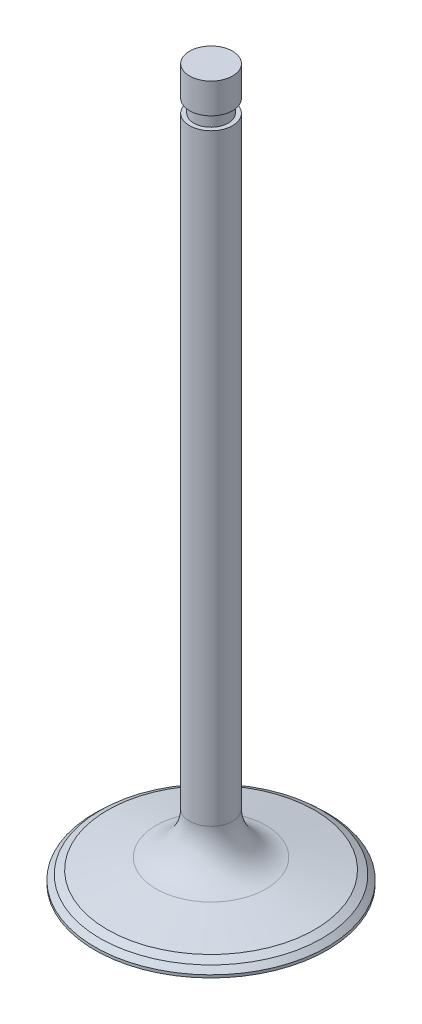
ISO-10303-21;
HEADER;
FILE_DESCRIPTION(('STEP AP214'),'2;1');
FILE_NAME('part.step','',(''),(''),'','','');
FILE_SCHEMA(('AUTOMOTIVE_DESIGN { 1 0 10303 214 1 1 1 1 }'));
ENDSEC;
DATA;
#1=APPLICATION_CONTEXT('core data for automotive mechanical design processes');
#2=APPLICATION_PROTOCOL_DEFINITION('international standard','automotive_design',2000,#1);
#3=PRODUCT_CONTEXT('',#1,'mechanical');
#4=PRODUCT('Part','Part','',(#3));
#5=PRODUCT_RELATED_PRODUCT_CATEGORY('part','',(#4));
#6=PRODUCT_DEFINITION_FORMATION('','',#4);
#7=PRODUCT_DEFINITION_CONTEXT('part definition',#1,'design');
#8=PRODUCT_DEFINITION('design','',#6,#7);
#9=PRODUCT_DEFINITION_SHAPE('','',#8);
#10=(LENGTH_UNIT() NAMED_UNIT(*) SI_UNIT(.MILLI.,.METRE.));
#11=(NAMED_UNIT(*) PLANE_ANGLE_UNIT() SI_UNIT($,.RADIAN.));
#12=(NAMED_UNIT(*) SI_UNIT($,.STERADIAN.) SOLID_ANGLE_UNIT());
#13=UNCERTAINTY_MEASURE_WITH_UNIT(LENGTH_MEASURE(1.E-05),#10,'distance_accuracy_value','');
#14=(GEOMETRIC_REPRESENTATION_CONTEXT(3) GLOBAL_UNCERTAINTY_ASSIGNED_CONTEXT((#13)) GLOBAL_UNIT_ASSIGNED_CONTEXT((#10,
#11,#12)) REPRESENTATION_CONTEXT('',''));
#15=CARTESIAN_POINT('',(0.,0.,0.));
#16=DIRECTION('',(0.,0.,1.));
#17=DIRECTION('',(1.,0.,0.));
#18=AXIS2_PLACEMENT_3D('',#15,#16,#17);
#19=CARTESIAN_POINT('',(0.,0.,0.));
#20=DIRECTION('',(0.,1.,0.));
#21=DIRECTION('',(0.,0.,1.));
#22=AXIS2_PLACEMENT_3D('',#19,#20,#21);
#23=PLANE('',#22);
#24=CARTESIAN_POINT('',(0.,0.,0.));
#25=DIRECTION('',(0.,-1.,0.));
#26=DIRECTION('',(0.,0.,-1.));
#27=AXIS2_PLACEMENT_3D('',#24,#25,#26);
#28=CIRCLE('',#27,27.);
#29=CARTESIAN_POINT('',(0.,0.,-27.));
#30=VERTEX_POINT('',#29);
#31=EDGE_CURVE('E62',#30,#30,#28,.T.);
#32=ORIENTED_EDGE('',*,*,#31,.T.);
#33=EDGE_LOOP('',(#32));
#34=FACE_BOUND('',#33,.T.);
#35=ADVANCED_FACE('F34',(#34),#23,.F.);
#36=CARTESIAN_POINT('',(0.,0.,0.));
#37=DIRECTION('',(0.,-1.,0.));
#38=DIRECTION('',(0.,0.,-1.));
#39=AXIS2_PLACEMENT_3D('',#36,#37,#38);
#40=CYLINDRICAL_SURFACE('',#39,27.);
#41=CARTESIAN_POINT('',(0.,0.637006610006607,0.));
#42=DIRECTION('',(0.,-1.,0.));
#43=DIRECTION('',(0.,0.,-1.));
#44=AXIS2_PLACEMENT_3D('',#41,#42,#43);
#45=CIRCLE('',#44,27.);
#46=CARTESIAN_POINT('',(0.,0.637006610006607,-27.));
#47=VERTEX_POINT('',#46);
#48=EDGE_CURVE('E47',#47,#47,#45,.T.);
#49=ORIENTED_EDGE('',*,*,#48,.T.);
#50=EDGE_LOOP('',(#49));
#51=FACE_BOUND('',#50,.T.);
#52=ORIENTED_EDGE('',*,*,#31,.F.);
#53=EDGE_LOOP('',(#52));
#54=FACE_BOUND('',#53,.T.);
#55=ADVANCED_FACE('F104',(#51,#54),#40,.T.);
#56=CARTESIAN_POINT('',(0.,7.,0.));
#57=DIRECTION('',(0.,-1.,0.));
#58=DIRECTION('',(0.,0.,-1.));
#59=AXIS2_PLACEMENT_3D('',#56,#57,#58);
#60=CONICAL_SURFACE('',#59,5.,1.34731972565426);
#61=CARTESIAN_POINT('',(0.,2.6648633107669,0.));
#62=DIRECTION('',(0.,-1.,0.));
#63=DIRECTION('',(0.,0.,-1.));
#64=AXIS2_PLACEMENT_3D('',#61,#62,#63);
#65=CIRCLE('',#64,24.0746014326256);
#66=CARTESIAN_POINT('',(0.,2.6648633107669,-24.0746014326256));
#67=VERTEX_POINT('',#66);
#68=EDGE_CURVE('E42',#67,#67,#65,.F.);
#69=ORIENTED_EDGE('',*,*,#68,.T.);
#70=EDGE_LOOP('',(#69));
#71=FACE_BOUND('',#70,.T.);
#72=CARTESIAN_POINT('',(0.,5.23095705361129,0.));
#73=DIRECTION('',(0.,-1.,0.));
#74=DIRECTION('',(0.,0.,-1.));
#75=AXIS2_PLACEMENT_3D('',#72,#73,#74);
#76=CIRCLE('',#75,12.7837889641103);
#77=CARTESIAN_POINT('',(0.,5.23095705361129,-12.7837889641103));
#78=VERTEX_POINT('',#77);
#79=EDGE_CURVE('E58',#78,#78,#76,.T.);
#80=ORIENTED_EDGE('',*,*,#79,.T.);
#81=EDGE_LOOP('',(#80));
#82=FACE_BOUND('',#81,.T.);
#83=ADVANCED_FACE('F110',(#71,#82),#60,.T.);
#84=CARTESIAN_POINT('',(0.,0.,0.));
#85=DIRECTION('',(0.,-1.,0.));
#86=DIRECTION('',(0.,0.,-1.));
#87=AXIS2_PLACEMENT_3D('',#84,#85,#86);
#88=CYLINDRICAL_SURFACE('',#87,5.);
#89=CARTESIAN_POINT('',(0.,14.9822856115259,0.));
#90=DIRECTION('',(0.,-1.,0.));
#91=DIRECTION('',(0.,0.,-1.));
#92=AXIS2_PLACEMENT_3D('',#89,#90,#91);
#93=CIRCLE('',#92,5.);
#94=CARTESIAN_POINT('',(0.,14.9822856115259,-5.));
#95=VERTEX_POINT('',#94);
#96=EDGE_CURVE('E52',#95,#95,#93,.F.);
#97=ORIENTED_EDGE('',*,*,#96,.T.);
#98=EDGE_LOOP('',(#97));
#99=FACE_BOUND('',#98,.T.);
#100=CARTESIAN_POINT('',(0.,155.,0.));
#101=DIRECTION('',(0.,-1.,0.));
#102=DIRECTION('',(0.,0.,-1.));
#103=AXIS2_PLACEMENT_3D('',#100,#101,#102);
#104=CIRCLE('',#103,5.);
#105=CARTESIAN_POINT('',(0.,155.,-5.));
#106=VERTEX_POINT('',#105);
#107=EDGE_CURVE('E66',#106,#106,#104,.T.);
#108=ORIENTED_EDGE('',*,*,#107,.T.);
#109=EDGE_LOOP('',(#108));
#110=FACE_BOUND('',#109,.T.);
#111=ADVANCED_FACE('F132',(#99,#110),#88,.T.);
#112=CARTESIAN_POINT('',(-4.,155.,0.));
#113=DIRECTION('',(0.,-1.,0.));
#114=DIRECTION('',(0.,0.,-1.));
#115=AXIS2_PLACEMENT_3D('',#112,#113,#114);
#116=PLANE('',#115);
#117=ORIENTED_EDGE('',*,*,#107,.F.);
#118=EDGE_LOOP('',(#117));
#119=FACE_BOUND('',#118,.T.);
#120=CARTESIAN_POINT('',(0.,155.,0.));
#121=DIRECTION('',(0.,-1.,0.));
#122=DIRECTION('',(0.,0.,-1.));
#123=AXIS2_PLACEMENT_3D('',#120,#121,#122);
#124=CIRCLE('',#123,4.);
#125=CARTESIAN_POINT('',(0.,155.,-4.));
#126=VERTEX_POINT('',#125);
#127=EDGE_CURVE('E70',#126,#126,#124,.T.);
#128=ORIENTED_EDGE('',*,*,#127,.T.);
#129=EDGE_LOOP('',(#128));
#130=FACE_BOUND('',#129,.T.);
#131=ADVANCED_FACE('F165',(#119,#130),#116,.F.);
#132=CARTESIAN_POINT('',(0.,0.,0.));
#133=DIRECTION('',(0.,-1.,0.));
#134=DIRECTION('',(0.,0.,-1.));
#135=AXIS2_PLACEMENT_3D('',#132,#133,#134);
#136=CYLINDRICAL_SURFACE('',#135,4.);
#137=ORIENTED_EDGE('',*,*,#127,.F.);
#138=EDGE_LOOP('',(#137));
#139=FACE_BOUND('',#138,.T.);
#140=CARTESIAN_POINT('',(0.,158.,0.));
#141=DIRECTION('',(0.,-1.,0.));
#142=DIRECTION('',(0.,0.,-1.));
#143=AXIS2_PLACEMENT_3D('',#140,#141,#142);
#144=CIRCLE('',#143,4.);
#145=CARTESIAN_POINT('',(0.,158.,-4.));
#146=VERTEX_POINT('',#145);
#147=EDGE_CURVE('E74',#146,#146,#144,.T.);
#148=ORIENTED_EDGE('',*,*,#147,.T.);
#149=EDGE_LOOP('',(#148));
#150=FACE_BOUND('',#149,.T.);
#151=ADVANCED_FACE('F157',(#139,#150),#136,.T.);
#152=CARTESIAN_POINT('',(-5.,158.,0.));
#153=DIRECTION('',(0.,1.,0.));
#154=DIRECTION('',(0.,0.,1.));
#155=AXIS2_PLACEMENT_3D('',#152,#153,#154);
#156=PLANE('',#155);
#157=ORIENTED_EDGE('',*,*,#147,.F.);
#158=EDGE_LOOP('',(#157));
#159=FACE_BOUND('',#158,.T.);
#160=CARTESIAN_POINT('',(0.,158.,0.));
#161=DIRECTION('',(0.,-1.,0.));
#162=DIRECTION('',(0.,0.,-1.));
#163=AXIS2_PLACEMENT_3D('',#160,#161,#162);
#164=CIRCLE('',#163,5.);
#165=CARTESIAN_POINT('',(0.,158.,-5.));
#166=VERTEX_POINT('',#165);
#167=EDGE_CURVE('E78',#166,#166,#164,.T.);
#168=ORIENTED_EDGE('',*,*,#167,.T.);
#169=EDGE_LOOP('',(#168));
#170=FACE_BOUND('',#169,.T.);
#171=ADVANCED_FACE('F100',(#159,#170),#156,.F.);
#172=CARTESIAN_POINT('',(0.,0.,0.));
#173=DIRECTION('',(0.,-1.,0.));
#174=DIRECTION('',(0.,0.,-1.));
#175=AXIS2_PLACEMENT_3D('',#172,#173,#174);
#176=CYLINDRICAL_SURFACE('',#175,5.);
#177=ORIENTED_EDGE('',*,*,#167,.F.);
#178=EDGE_LOOP('',(#177));
#179=FACE_BOUND('',#178,.T.);
#180=CARTESIAN_POINT('',(0.,165.,0.));
#181=DIRECTION('',(0.,-1.,0.));
#182=DIRECTION('',(0.,0.,-1.));
#183=AXIS2_PLACEMENT_3D('',#180,#181,#182);
#184=CIRCLE('',#183,5.);
#185=CARTESIAN_POINT('',(0.,165.,-5.));
#186=VERTEX_POINT('',#185);
#187=EDGE_CURVE('E82',#186,#186,#184,.T.);
#188=ORIENTED_EDGE('',*,*,#187,.T.);
#189=EDGE_LOOP('',(#188));
#190=FACE_BOUND('',#189,.T.);
#191=ADVANCED_FACE('F87',(#179,#190),#176,.T.);
#192=CARTESIAN_POINT('',(-5.,165.,0.));
#193=DIRECTION('',(0.,-1.,0.));
#194=DIRECTION('',(0.,0.,-1.));
#195=AXIS2_PLACEMENT_3D('',#192,#193,#194);
#196=PLANE('',#195);
#197=ORIENTED_EDGE('',*,*,#187,.F.);
#198=EDGE_LOOP('',(#197));
#199=FACE_BOUND('',#198,.T.);
#200=ADVANCED_FACE('F89',(#199),#196,.F.);
#201=CARTESIAN_POINT('',(0.,14.9822856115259,0.));
#202=DIRECTION('',(0.,-1.,0.));
#203=DIRECTION('',(0.,0.,-1.));
#204=AXIS2_PLACEMENT_3D('',#201,#202,#203);
#205=TOROIDAL_SURFACE('',#204,15.,10.);
#206=ORIENTED_EDGE('',*,*,#96,.F.);
#207=EDGE_LOOP('',(#206));
#208=FACE_BOUND('',#207,.T.);
#209=ORIENTED_EDGE('',*,*,#79,.F.);
#210=EDGE_LOOP('',(#209));
#211=FACE_BOUND('',#210,.T.);
#212=ADVANCED_FACE('F91',(#208,#211),#205,.F.);
#213=CARTESIAN_POINT('',(0.,0.637006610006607,0.));
#214=DIRECTION('',(0.,-1.,0.));
#215=DIRECTION('',(0.,0.,-1.));
#216=AXIS2_PLACEMENT_3D('',#213,#214,#215);
#217=CONICAL_SURFACE('',#216,27.,0.823720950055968);
#218=CARTESIAN_POINT('',(0.,1.76374627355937,0.));
#219=DIRECTION('',(0.,-1.,0.));
#220=DIRECTION('',(0.,0.,-1.));
#221=AXIS2_PLACEMENT_3D('',#218,#219,#220);
#222=CIRCLE('',#221,25.7834135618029);
#223=CARTESIAN_POINT('',(0.,1.76374627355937,-25.7834135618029));
#224=VERTEX_POINT('',#223);
#225=EDGE_CURVE('E10',#224,#224,#222,.T.);
#226=ORIENTED_EDGE('',*,*,#225,.T.);
#227=EDGE_LOOP('',(#226));
#228=FACE_BOUND('',#227,.T.);
#229=ORIENTED_EDGE('',*,*,#48,.F.);
#230=EDGE_LOOP('',(#229));
#231=FACE_BOUND('',#230,.T.);
#232=ADVANCED_FACE('F97',(#228,#231),#217,.T.);
#233=CARTESIAN_POINT('',(0.,2.66486331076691,0.));
#234=DIRECTION('',(0.,-1.,0.));
#235=DIRECTION('',(0.,0.,-1.));
#236=AXIS2_PLACEMENT_3D('',#233,#234,#235);
#237=CONICAL_SURFACE('',#236,24.0746014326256,1.08552033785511);
#238=CARTESIAN_POINT('',(0.,1.76374627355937,-25.7834135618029));
#239=CARTESIAN_POINT('',(0.,1.77313290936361,-25.7656134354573));
#240=CARTESIAN_POINT('',(0.,1.78251954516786,-25.7478133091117));
#241=CARTESIAN_POINT('',(0.,1.80129281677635,-25.7122130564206));
#242=CARTESIAN_POINT('',(0.,1.81067945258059,-25.694412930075));
#243=CARTESIAN_POINT('',(0.,1.82945272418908,-25.6588126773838));
#244=CARTESIAN_POINT('',(0.,1.83883935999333,-25.6410125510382));
#245=CARTESIAN_POINT('',(0.,1.85761263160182,-25.605412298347));
#246=CARTESIAN_POINT('',(0.,1.86699926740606,-25.5876121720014));
#247=CARTESIAN_POINT('',(0.,1.88577253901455,-25.5520119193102));
#248=CARTESIAN_POINT('',(0.,1.8951591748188,-25.5342117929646));
#249=CARTESIAN_POINT('',(0.,1.91393244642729,-25.4986115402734));
#250=CARTESIAN_POINT('',(0.,1.92331908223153,-25.4808114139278));
#251=CARTESIAN_POINT('',(0.,1.94209235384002,-25.4452111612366));
#252=CARTESIAN_POINT('',(0.,1.95147898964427,-25.427411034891));
#253=CARTESIAN_POINT('',(0.,1.97025226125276,-25.3918107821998));
#254=CARTESIAN_POINT('',(0.,1.97963889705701,-25.3740106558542));
#255=CARTESIAN_POINT('',(0.,1.9984121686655,-25.338410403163));
#256=CARTESIAN_POINT('',(0.,2.00779880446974,-25.3206102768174));
#257=CARTESIAN_POINT('',(0.,2.02657207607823,-25.2850100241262));
#258=CARTESIAN_POINT('',(0.,2.03595871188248,-25.2672098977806));
#259=CARTESIAN_POINT('',(0.,2.05473198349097,-25.2316096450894));
#260=CARTESIAN_POINT('',(0.,2.06411861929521,-25.2138095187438));
#261=CARTESIAN_POINT('',(0.,2.0828918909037,-25.1782092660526));
#262=CARTESIAN_POINT('',(0.,2.09227852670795,-25.160409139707));
#263=CARTESIAN_POINT('',(0.,2.11105179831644,-25.1248088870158));
#264=CARTESIAN_POINT('',(0.,2.12043843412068,-25.1070087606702));
#265=CARTESIAN_POINT('',(0.,2.13921170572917,-25.071408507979));
#266=CARTESIAN_POINT('',(0.,2.14859834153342,-25.0536083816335));
#267=CARTESIAN_POINT('',(0.,2.16737161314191,-25.0180081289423));
#268=CARTESIAN_POINT('',(0.,2.17675824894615,-25.0002080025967));
#269=CARTESIAN_POINT('',(0.,2.19553152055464,-24.9646077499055));
#270=CARTESIAN_POINT('',(0.,2.20491815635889,-24.9468076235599));
#271=CARTESIAN_POINT('',(0.,2.22369142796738,-24.9112073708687));
#272=CARTESIAN_POINT('',(0.,2.23307806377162,-24.8934072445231));
#273=CARTESIAN_POINT('',(0.,2.25185133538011,-24.8578069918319));
#274=CARTESIAN_POINT('',(0.,2.26123797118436,-24.8400068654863));
#275=CARTESIAN_POINT('',(0.,2.28001124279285,-24.8044066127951));
#276=CARTESIAN_POINT('',(0.,2.2893978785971,-24.7866064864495));
#277=CARTESIAN_POINT('',(0.,2.30817115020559,-24.7510062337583));
#278=CARTESIAN_POINT('',(0.,2.31755778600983,-24.7332061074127));
#279=CARTESIAN_POINT('',(0.,2.33633105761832,-24.6976058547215));
#280=CARTESIAN_POINT('',(0.,2.34571769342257,-24.6798057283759));
#281=CARTESIAN_POINT('',(0.,2.36449096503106,-24.6442054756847));
#282=CARTESIAN_POINT('',(0.,2.3738776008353,-24.6264053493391));
#283=CARTESIAN_POINT('',(0.,2.39265087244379,-24.5908050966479));
#284=CARTESIAN_POINT('',(0.,2.40203750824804,-24.5730049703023));
#285=CARTESIAN_POINT('',(0.,2.42081077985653,-24.5374047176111));
#286=CARTESIAN_POINT('',(0.,2.43019741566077,-24.5196045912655));
#287=CARTESIAN_POINT('',(0.,2.44897068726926,-24.4840043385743));
#288=CARTESIAN_POINT('',(0.,2.45835732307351,-24.4662042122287));
#289=CARTESIAN_POINT('',(0.,2.477130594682,-24.4306039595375));
#290=CARTESIAN_POINT('',(0.,2.48651723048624,-24.412803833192));
#291=CARTESIAN_POINT('',(0.,2.50529050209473,-24.3772035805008));
#292=CARTESIAN_POINT('',(0.,2.51467713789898,-24.3594034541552));
#293=CARTESIAN_POINT('',(0.,2.53345040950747,-24.323803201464));
#294=CARTESIAN_POINT('',(0.,2.54283704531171,-24.3060030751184));
#295=CARTESIAN_POINT('',(0.,2.56161031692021,-24.2704028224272));
#296=CARTESIAN_POINT('',(0.,2.57099695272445,-24.2526026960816));
#297=CARTESIAN_POINT('',(0.,2.58977022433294,-24.2170024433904));
#298=CARTESIAN_POINT('',(0.,2.59915686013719,-24.1992023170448));
#299=CARTESIAN_POINT('',(0.,2.61793013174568,-24.1636020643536));
#300=CARTESIAN_POINT('',(0.,2.62731676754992,-24.145801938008));
#301=CARTESIAN_POINT('',(0.,2.64609003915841,-24.1102016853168));
#302=CARTESIAN_POINT('',(0.,2.65547667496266,-24.0924015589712));
#303=CARTESIAN_POINT('',(0.,2.6648633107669,-24.0746014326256));
#304=B_SPLINE_CURVE_WITH_KNOTS('',3,(#238,#239,#240,#241,#242,#243,#244,#245,#246,#247,#248,
#249,#250,#251,#252,#253,#254,#255,#256,#257,#258,#259,#260,#261,#262,#263,#264,#265,#266,#267,
#268,#269,#270,#271,#272,#273,#274,#275,#276,#277,#278,#279,#280,#281,#282,#283,#284,#285,#286,
#287,#288,#289,#290,#291,#292,#293,#294,#295,#296,#297,#298,#299,#300,#301,#302,#303),
.UNSPECIFIED.,.F.,.F.,(4,2,2,2,2,2,2,2,2,2,2,2,2,2,2,2,2,2,2,2,2,2,2,2,2,2,2,2,2,2,2,2,4),(0.,
0.0603703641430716,0.12074072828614,0.181111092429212,0.24148145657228,0.301851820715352,
0.36222218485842,0.422592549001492,0.48296291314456,0.543333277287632,0.6037036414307,
0.664074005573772,0.72444436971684,0.784814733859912,0.845185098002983,0.905555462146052,
0.965925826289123,1.02629619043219,1.08666655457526,1.14703691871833,1.2074072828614,
1.26777764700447,1.32814801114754,1.38851837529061,1.44888873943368,1.50925910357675,
1.56962946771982,1.62999983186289,1.69037019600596,1.75074056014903,1.8111109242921,
1.87148128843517,1.93185165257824),.UNSPECIFIED.);
#305=EDGE_CURVE('BSEAM36',#224,#67,#304,.T.);
#306=ORIENTED_EDGE('',*,*,#225,.F.);
#307=ORIENTED_EDGE('',*,*,#68,.F.);
#308=ORIENTED_EDGE('',*,*,#305,.T.);
#309=ORIENTED_EDGE('',*,*,#305,.F.);
#310=EDGE_LOOP('',(#306,#308,#307,#309));
#311=FACE_BOUND('',#310,.T.);
#312=ADVANCED_FACE('F36',(#311),#237,.T.);
#313=CLOSED_SHELL('',(#35,#55,#83,#111,#131,#151,#171,#191,#200,#212,#232,#312));
#314=MANIFOLD_SOLID_BREP('B2',#313);
#315=ADVANCED_BREP_SHAPE_REPRESENTATION('',(#18,#314),#14);
#316=SHAPE_DEFINITION_REPRESENTATION(#9,#315);
ENDSEC;
END-ISO-10303-21;
